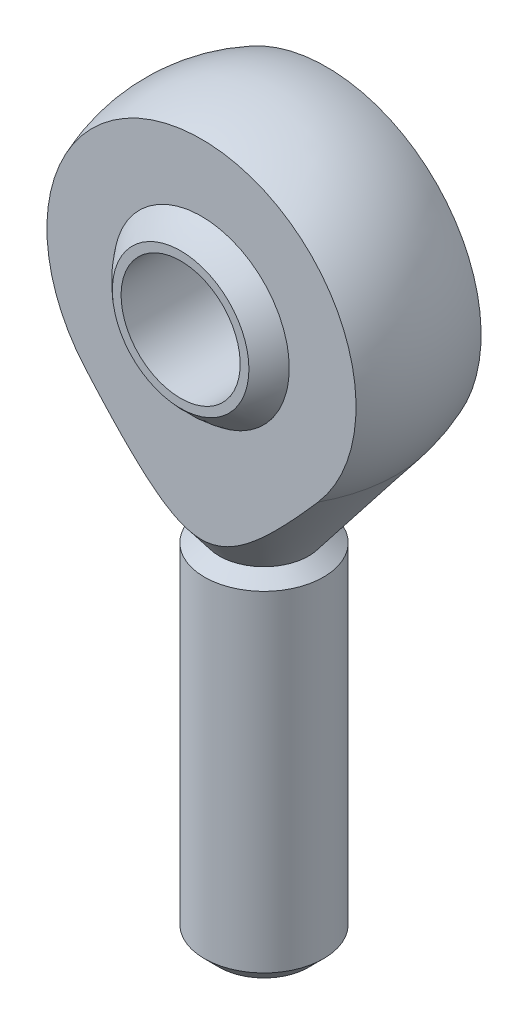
ISO-10303-21;
HEADER;
FILE_DESCRIPTION(('STEP AP214'),'2;1');
FILE_NAME('part.step','',(''),(''),'','','');
FILE_SCHEMA(('AUTOMOTIVE_DESIGN { 1 0 10303 214 1 1 1 1 }'));
ENDSEC;
DATA;
#1=APPLICATION_CONTEXT('core data for automotive mechanical design processes');
#2=APPLICATION_PROTOCOL_DEFINITION('international standard','automotive_design',2000,#1);
#3=PRODUCT_CONTEXT('',#1,'mechanical');
#4=PRODUCT('Part','Part','',(#3));
#5=PRODUCT_RELATED_PRODUCT_CATEGORY('part','',(#4));
#6=PRODUCT_DEFINITION_FORMATION('','',#4);
#7=PRODUCT_DEFINITION_CONTEXT('part definition',#1,'design');
#8=PRODUCT_DEFINITION('design','',#6,#7);
#9=PRODUCT_DEFINITION_SHAPE('','',#8);
#10=(LENGTH_UNIT() NAMED_UNIT(*) SI_UNIT(.MILLI.,.METRE.));
#11=(NAMED_UNIT(*) PLANE_ANGLE_UNIT() SI_UNIT($,.RADIAN.));
#12=(NAMED_UNIT(*) SI_UNIT($,.STERADIAN.) SOLID_ANGLE_UNIT());
#13=UNCERTAINTY_MEASURE_WITH_UNIT(LENGTH_MEASURE(1.E-05),#10,'distance_accuracy_value','');
#14=(GEOMETRIC_REPRESENTATION_CONTEXT(3) GLOBAL_UNCERTAINTY_ASSIGNED_CONTEXT((#13)) GLOBAL_UNIT_ASSIGNED_CONTEXT((#10,
#11,#12)) REPRESENTATION_CONTEXT('',''));
#15=CARTESIAN_POINT('',(0.,0.,0.));
#16=DIRECTION('',(0.,0.,1.));
#17=DIRECTION('',(1.,0.,0.));
#18=AXIS2_PLACEMENT_3D('',#15,#16,#17);
#19=CARTESIAN_POINT('',(0.,0.,0.));
#20=DIRECTION('',(0.,0.,1.));
#21=DIRECTION('',(-1.,0.,0.));
#22=AXIS2_PLACEMENT_3D('',#19,#20,#21);
#23=SPHERICAL_SURFACE('',#22,9.04875);
#24=CARTESIAN_POINT('',(0.,0.,-5.25000000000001));
#25=DIRECTION('',(0.,0.,1.));
#26=DIRECTION('',(1.,0.,0.));
#27=AXIS2_PLACEMENT_3D('',#24,#25,#26);
#28=CIRCLE('',#27,7.3700323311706);
#29=CARTESIAN_POINT('',(7.3700323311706,0.,-5.25000000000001));
#30=VERTEX_POINT('',#29);
#31=EDGE_CURVE('P0_E53',#30,#30,#28,.T.);
#32=ORIENTED_EDGE('',*,*,#31,.F.);
#33=EDGE_LOOP('',(#32));
#34=FACE_BOUND('',#33,.T.);
#35=CARTESIAN_POINT('',(0.,0.,5.25));
#36=DIRECTION('',(0.,0.,1.));
#37=DIRECTION('',(1.,0.,0.));
#38=AXIS2_PLACEMENT_3D('',#35,#36,#37);
#39=CIRCLE('',#38,7.3700323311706);
#40=CARTESIAN_POINT('',(7.3700323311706,0.,5.25));
#41=VERTEX_POINT('',#40);
#42=EDGE_CURVE('P0_E21',#41,#41,#39,.F.);
#43=ORIENTED_EDGE('',*,*,#42,.F.);
#44=EDGE_LOOP('',(#43));
#45=FACE_BOUND('',#44,.T.);
#46=ADVANCED_FACE('P0_F17',(#34,#45),#23,.F.);
#47=CARTESIAN_POINT('',(12.9783473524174,-19.7418582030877,5.25));
#48=CARTESIAN_POINT('',(12.9783473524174,12.9783473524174,5.25));
#49=CARTESIAN_POINT('',(12.9783473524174,13.3055494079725,5.25));
#50=B_SPLINE_CURVE_WITH_KNOTS('',1,(#47,#48,#49),.UNSPECIFIED.,.F.,.F.,(2,1,2),(0.,1.,1.01),.UNSPECIFIED.);
#51=DIRECTION('',(-1.,0.,0.));
#52=VECTOR('',#51,1.);
#53=SURFACE_OF_LINEAR_EXTRUSION('',#50,#52);
#54=ORIENTED_EDGE('',*,*,#42,.T.);
#55=EDGE_LOOP('',(#54));
#56=FACE_BOUND('',#55,.T.);
#57=CARTESIAN_POINT('',(0.,0.,5.25));
#58=DIRECTION('',(0.,0.,1.));
#59=DIRECTION('',(1.,0.,0.));
#60=AXIS2_PLACEMENT_3D('',#57,#58,#59);
#61=CIRCLE('',#60,12.9783473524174);
#62=CARTESIAN_POINT('',(-9.77969864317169,-8.53199826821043,5.25));
#63=VERTEX_POINT('',#62);
#64=CARTESIAN_POINT('',(9.77969864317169,-8.53199826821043,5.25));
#65=VERTEX_POINT('',#64);
#66=EDGE_CURVE('P0_E48',#63,#65,#61,.F.);
#67=ORIENTED_EDGE('',*,*,#66,.F.);
#68=CARTESIAN_POINT('',(9.77969864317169,-8.53199826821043,5.25));
#69=CARTESIAN_POINT('',(9.59097869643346,-8.74829449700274,5.25));
#70=CARTESIAN_POINT('',(9.40158357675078,-8.96400566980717,5.25));
#71=CARTESIAN_POINT('',(9.02091170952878,-9.39427916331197,5.25));
#72=CARTESIAN_POINT('',(8.82963277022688,-9.60883954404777,5.25));
#73=CARTESIAN_POINT('',(8.44501454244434,-10.0364201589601,5.25));
#74=CARTESIAN_POINT('',(8.25167372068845,-10.249439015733,5.25));
#75=CARTESIAN_POINT('',(7.86266047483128,-10.6734599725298,5.25));
#76=CARTESIAN_POINT('',(7.6669873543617,-10.8844614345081,5.25));
#77=CARTESIAN_POINT('',(7.27256005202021,-11.3042814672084,5.25));
#78=CARTESIAN_POINT('',(7.07380097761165,-11.5130954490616,5.25));
#79=CARTESIAN_POINT('',(6.6730216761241,-11.9274511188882,5.25));
#80=CARTESIAN_POINT('',(6.47100249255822,-12.1329938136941,5.25));
#81=CARTESIAN_POINT('',(6.06296651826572,-12.5399149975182,5.25));
#82=CARTESIAN_POINT('',(5.85695138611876,-12.7412951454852,5.25));
#83=CARTESIAN_POINT('',(5.4398911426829,-13.1387229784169,5.25));
#84=CARTESIAN_POINT('',(5.22884706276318,-13.3347717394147,5.25));
#85=CARTESIAN_POINT('',(4.86593865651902,-13.6608677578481,5.25));
#86=CARTESIAN_POINT('',(4.71572830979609,-13.7927529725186,5.25));
#87=CARTESIAN_POINT('',(4.41165704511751,-14.0522806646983,5.25));
#88=CARTESIAN_POINT('',(4.2577959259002,-14.1799229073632,5.25));
#89=CARTESIAN_POINT('',(3.94511498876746,-14.4303670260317,5.25));
#90=CARTESIAN_POINT('',(3.78627727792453,-14.5531466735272,5.25));
#91=CARTESIAN_POINT('',(3.46344733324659,-14.7917755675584,5.25));
#92=CARTESIAN_POINT('',(3.2994551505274,-14.9076248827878,5.25));
#93=CARTESIAN_POINT('',(2.96273128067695,-15.1320831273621,5.25));
#94=CARTESIAN_POINT('',(2.78990178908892,-15.240546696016,5.25));
#95=CARTESIAN_POINT('',(2.43693390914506,-15.4451795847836,5.25));
#96=CARTESIAN_POINT('',(2.25679300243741,-15.5413446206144,5.25));
#97=CARTESIAN_POINT('',(1.8897568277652,-15.7166883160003,5.25));
#98=CARTESIAN_POINT('',(1.70291361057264,-15.7959742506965,5.25));
#99=CARTESIAN_POINT('',(1.321580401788,-15.9332463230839,5.25000000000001));
#100=CARTESIAN_POINT('',(1.12710059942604,-15.9912598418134,5.25000000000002));
#101=CARTESIAN_POINT('',(0.811335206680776,-16.0629011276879,5.25000000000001));
#102=CARTESIAN_POINT('',(0.691950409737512,-16.0849994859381,5.25));
#103=CARTESIAN_POINT('',(0.451709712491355,-16.1188355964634,5.25));
#104=CARTESIAN_POINT('',(0.330854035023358,-16.1305748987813,5.25));
#105=CARTESIAN_POINT('',(0.088650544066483,-16.1431518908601,5.25));
#106=CARTESIAN_POINT('',(-0.0326969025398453,-16.1439965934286,5.25));
#107=CARTESIAN_POINT('',(-0.274976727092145,-16.1347649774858,5.25));
#108=CARTESIAN_POINT('',(-0.395909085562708,-16.124688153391,5.25));
#109=CARTESIAN_POINT('',(-0.635827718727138,-16.0941499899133,5.25));
#110=CARTESIAN_POINT('',(-0.75482067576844,-16.0737404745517,5.25));
#111=CARTESIAN_POINT('',(-0.99078084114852,-16.0234002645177,5.25));
#112=CARTESIAN_POINT('',(-1.10774757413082,-15.9934673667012,5.25));
#113=CARTESIAN_POINT('',(-1.3393386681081,-15.9250890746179,5.25));
#114=CARTESIAN_POINT('',(-1.45395913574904,-15.8866306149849,5.25));
#115=CARTESIAN_POINT('',(-1.68043389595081,-15.8023536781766,5.25));
#116=CARTESIAN_POINT('',(-1.79228816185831,-15.7565351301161,5.25));
#117=CARTESIAN_POINT('',(-2.08281600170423,-15.6277529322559,5.25));
#118=CARTESIAN_POINT('',(-2.25917968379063,-15.5395763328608,5.25));
#119=CARTESIAN_POINT('',(-2.60511068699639,-15.3504132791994,5.25));
#120=CARTESIAN_POINT('',(-2.77466721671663,-15.2494074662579,5.25));
#121=CARTESIAN_POINT('',(-3.10770819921,-15.0376453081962,5.25));
#122=CARTESIAN_POINT('',(-3.27118791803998,-14.9268815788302,5.25));
#123=CARTESIAN_POINT('',(-3.59469152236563,-14.6965949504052,5.25));
#124=CARTESIAN_POINT('',(-3.75465302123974,-14.5769850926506,5.25));
#125=CARTESIAN_POINT('',(-4.06981430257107,-14.3319871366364,5.25));
#126=CARTESIAN_POINT('',(-4.22501854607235,-14.2066047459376,5.25));
#127=CARTESIAN_POINT('',(-4.53150386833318,-13.9512323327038,5.25));
#128=CARTESIAN_POINT('',(-4.68278594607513,-13.821243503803,5.25));
#129=CARTESIAN_POINT('',(-5.01584234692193,-13.5278029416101,5.25));
#130=CARTESIAN_POINT('',(-5.19679378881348,-13.3634193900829,5.25));
#131=CARTESIAN_POINT('',(-5.55470103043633,-13.0302986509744,5.25));
#132=CARTESIAN_POINT('',(-5.73165593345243,-12.8615605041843,5.25));
#133=CARTESIAN_POINT('',(-6.08231113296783,-12.5205828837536,5.25));
#134=CARTESIAN_POINT('',(-6.25600988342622,-12.3483418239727,5.25));
#135=CARTESIAN_POINT('',(-6.60070014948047,-12.0010245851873,5.25));
#136=CARTESIAN_POINT('',(-6.77169041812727,-11.8259471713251,5.25));
#137=CARTESIAN_POINT('',(-7.11137512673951,-11.4734861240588,5.25));
#138=CARTESIAN_POINT('',(-7.28006889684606,-11.2961018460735,5.25));
#139=CARTESIAN_POINT('',(-7.60701262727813,-10.948452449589,5.25));
#140=CARTESIAN_POINT('',(-7.76536039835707,-10.7782791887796,5.25));
#141=CARTESIAN_POINT('',(-8.08046888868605,-10.4365510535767,5.25));
#142=CARTESIAN_POINT('',(-8.23723000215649,-10.2649965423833,5.25));
#143=CARTESIAN_POINT('',(-8.54931138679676,-9.92078147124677,5.25));
#144=CARTESIAN_POINT('',(-8.70463251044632,-9.74812168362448,5.25));
#145=CARTESIAN_POINT('',(-9.01394446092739,-9.40193981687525,5.25));
#146=CARTESIAN_POINT('',(-9.16793650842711,-9.22841882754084,5.25));
#147=CARTESIAN_POINT('',(-9.47466567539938,-8.88072577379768,5.25));
#148=CARTESIAN_POINT('',(-9.62740431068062,-8.7065550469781,5.25));
#149=CARTESIAN_POINT('',(-9.77969864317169,-8.53199826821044,5.25));
#150=B_SPLINE_CURVE_WITH_KNOTS('',3,(#68,#69,#70,#71,#72,#73,#74,#75,#76,#77,#78,#79,#80,#81,
#82,#83,#84,#85,#86,#87,#88,#89,#90,#91,#92,#93,#94,#95,#96,#97,#98,#99,#100,#101,#102,#103,
#104,#105,#106,#107,#108,#109,#110,#111,#112,#113,#114,#115,#116,#117,#118,#119,#120,#121,#122,
#123,#124,#125,#126,#127,#128,#129,#130,#131,#132,#133,#134,#135,#136,#137,#138,#139,#140,#141,
#142,#143,#144,#145,#146,#147,#148,#149),.UNSPECIFIED.,.F.,.F.,(4,2,2,2,2,2,2,2,2,2,2,2,2,2,2,2,
2,2,2,2,2,2,2,2,2,2,2,2,2,2,2,2,2,2,2,2,2,2,2,2,4),(0.,0.861161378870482,1.72348327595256,
2.58649867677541,3.44977855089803,4.31460528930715,5.17916049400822,6.04336422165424,
6.90739221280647,7.50700713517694,8.10665519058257,8.70878595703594,9.3109107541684,
9.92266168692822,10.5346251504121,11.1425748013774,11.7497391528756,12.1135837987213,
12.4773739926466,12.8409300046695,13.2045028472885,13.5662699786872,13.9281208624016,
14.2905301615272,14.6529429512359,15.2437300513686,15.8354194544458,16.4275605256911,
17.0265950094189,17.6250494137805,18.22334986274,18.9566645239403,19.6901421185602,
20.4239595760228,21.1581055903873,21.8924613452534,22.5898001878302,23.2869612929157,
23.9836792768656,24.6796691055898,25.3746325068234),.UNSPECIFIED.);
#151=EDGE_CURVE('P0_E51',#65,#63,#150,.T.);
#152=ORIENTED_EDGE('',*,*,#151,.F.);
#153=EDGE_LOOP('',(#67,#152));
#154=FACE_BOUND('',#153,.T.);
#155=ADVANCED_FACE('P0_F50',(#56,#154),#53,.T.);
#156=CARTESIAN_POINT('',(12.9783473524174,13.3055494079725,-5.25000000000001));
#157=CARTESIAN_POINT('',(12.9783473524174,12.9783473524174,-5.25000000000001));
#158=CARTESIAN_POINT('',(12.9783473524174,-19.7418582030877,-5.25000000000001));
#159=B_SPLINE_CURVE_WITH_KNOTS('',1,(#156,#157,#158),.UNSPECIFIED.,.F.,.F.,(2,1,2),(-0.01,0.,
1.),.UNSPECIFIED.);
#160=DIRECTION('',(-1.,0.,0.));
#161=VECTOR('',#160,1.);
#162=SURFACE_OF_LINEAR_EXTRUSION('',#159,#161);
#163=ORIENTED_EDGE('',*,*,#31,.T.);
#164=EDGE_LOOP('',(#163));
#165=FACE_BOUND('',#164,.T.);
#166=CARTESIAN_POINT('',(-9.77969864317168,-8.53199826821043,-5.25000000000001));
#167=CARTESIAN_POINT('',(-9.59097869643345,-8.74829449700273,-5.25000000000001));
#168=CARTESIAN_POINT('',(-9.40158357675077,-8.96400566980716,-5.25000000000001));
#169=CARTESIAN_POINT('',(-9.02091170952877,-9.39427916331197,-5.25000000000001));
#170=CARTESIAN_POINT('',(-8.82963277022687,-9.60883954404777,-5.25000000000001));
#171=CARTESIAN_POINT('',(-8.44501454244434,-10.0364201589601,-5.25000000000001));
#172=CARTESIAN_POINT('',(-8.25167372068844,-10.249439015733,-5.25000000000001));
#173=CARTESIAN_POINT('',(-7.86266047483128,-10.6734599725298,-5.25000000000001));
#174=CARTESIAN_POINT('',(-7.66698735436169,-10.8844614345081,-5.25000000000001));
#175=CARTESIAN_POINT('',(-7.27256005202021,-11.3042814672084,-5.25000000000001));
#176=CARTESIAN_POINT('',(-7.07380097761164,-11.5130954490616,-5.25000000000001));
#177=CARTESIAN_POINT('',(-6.6730216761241,-11.9274511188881,-5.25000000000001));
#178=CARTESIAN_POINT('',(-6.47100249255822,-12.1329938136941,-5.25000000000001));
#179=CARTESIAN_POINT('',(-6.06296651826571,-12.5399149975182,-5.25000000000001));
#180=CARTESIAN_POINT('',(-5.85695138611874,-12.7412951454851,-5.25000000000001));
#181=CARTESIAN_POINT('',(-5.43989114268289,-13.1387229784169,-5.25000000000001));
#182=CARTESIAN_POINT('',(-5.22884706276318,-13.3347717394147,-5.25000000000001));
#183=CARTESIAN_POINT('',(-4.86593865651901,-13.6608677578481,-5.25000000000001));
#184=CARTESIAN_POINT('',(-4.71572830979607,-13.7927529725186,-5.25000000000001));
#185=CARTESIAN_POINT('',(-4.4116570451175,-14.0522806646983,-5.25000000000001));
#186=CARTESIAN_POINT('',(-4.25779592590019,-14.1799229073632,-5.25000000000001));
#187=CARTESIAN_POINT('',(-3.94511498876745,-14.4303670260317,-5.25000000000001));
#188=CARTESIAN_POINT('',(-3.78627727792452,-14.5531466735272,-5.25000000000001));
#189=CARTESIAN_POINT('',(-3.46344733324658,-14.7917755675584,-5.25000000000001));
#190=CARTESIAN_POINT('',(-3.29945515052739,-14.9076248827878,-5.25000000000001));
#191=CARTESIAN_POINT('',(-2.96273128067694,-15.1320831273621,-5.25000000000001));
#192=CARTESIAN_POINT('',(-2.78990178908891,-15.240546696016,-5.25000000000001));
#193=CARTESIAN_POINT('',(-2.43693390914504,-15.4451795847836,-5.25000000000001));
#194=CARTESIAN_POINT('',(-2.2567930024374,-15.5413446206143,-5.25000000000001));
#195=CARTESIAN_POINT('',(-1.88975682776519,-15.7166883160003,-5.25000000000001));
#196=CARTESIAN_POINT('',(-1.70291361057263,-15.7959742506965,-5.25));
#197=CARTESIAN_POINT('',(-1.32158040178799,-15.9332463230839,-5.25000000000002));
#198=CARTESIAN_POINT('',(-1.12710059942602,-15.9912598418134,-5.25000000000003));
#199=CARTESIAN_POINT('',(-0.811335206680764,-16.0629011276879,-5.25000000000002));
#200=CARTESIAN_POINT('',(-0.6919504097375,-16.0849994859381,-5.25000000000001));
#201=CARTESIAN_POINT('',(-0.451709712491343,-16.1188355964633,-5.25000000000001));
#202=CARTESIAN_POINT('',(-0.330854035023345,-16.1305748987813,-5.25000000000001));
#203=CARTESIAN_POINT('',(-0.0886505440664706,-16.14315189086,-5.25000000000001));
#204=CARTESIAN_POINT('',(0.0326969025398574,-16.1439965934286,-5.25000000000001));
#205=CARTESIAN_POINT('',(0.274976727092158,-16.1347649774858,-5.25000000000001));
#206=CARTESIAN_POINT('',(0.395909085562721,-16.124688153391,-5.25000000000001));
#207=CARTESIAN_POINT('',(0.63582771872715,-16.0941499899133,-5.25000000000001));
#208=CARTESIAN_POINT('',(0.75482067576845,-16.0737404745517,-5.25000000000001));
#209=CARTESIAN_POINT('',(0.990780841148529,-16.0234002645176,-5.25000000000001));
#210=CARTESIAN_POINT('',(1.10774757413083,-15.9934673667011,-5.25000000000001));
#211=CARTESIAN_POINT('',(1.33933866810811,-15.9250890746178,-5.25000000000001));
#212=CARTESIAN_POINT('',(1.45395913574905,-15.8866306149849,-5.25000000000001));
#213=CARTESIAN_POINT('',(1.68043389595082,-15.8023536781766,-5.25000000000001));
#214=CARTESIAN_POINT('',(1.79228816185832,-15.756535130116,-5.25000000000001));
#215=CARTESIAN_POINT('',(2.08281600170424,-15.6277529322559,-5.25000000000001));
#216=CARTESIAN_POINT('',(2.25917968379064,-15.5395763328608,-5.25000000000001));
#217=CARTESIAN_POINT('',(2.6051106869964,-15.3504132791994,-5.25000000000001));
#218=CARTESIAN_POINT('',(2.77466721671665,-15.2494074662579,-5.25000000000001));
#219=CARTESIAN_POINT('',(3.10770819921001,-15.0376453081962,-5.25000000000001));
#220=CARTESIAN_POINT('',(3.27118791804,-14.9268815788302,-5.25000000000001));
#221=CARTESIAN_POINT('',(3.59469152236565,-14.6965949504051,-5.25000000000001));
#222=CARTESIAN_POINT('',(3.75465302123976,-14.5769850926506,-5.25000000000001));
#223=CARTESIAN_POINT('',(4.0698143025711,-14.3319871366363,-5.25000000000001));
#224=CARTESIAN_POINT('',(4.22501854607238,-14.2066047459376,-5.25000000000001));
#225=CARTESIAN_POINT('',(4.53150386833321,-13.9512323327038,-5.25000000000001));
#226=CARTESIAN_POINT('',(4.68278594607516,-13.821243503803,-5.25000000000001));
#227=CARTESIAN_POINT('',(5.01584234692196,-13.52780294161,-5.25000000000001));
#228=CARTESIAN_POINT('',(5.19679378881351,-13.3634193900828,-5.25000000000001));
#229=CARTESIAN_POINT('',(5.55470103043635,-13.0302986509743,-5.25000000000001));
#230=CARTESIAN_POINT('',(5.73165593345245,-12.8615605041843,-5.25000000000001));
#231=CARTESIAN_POINT('',(6.08231113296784,-12.5205828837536,-5.25000000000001));
#232=CARTESIAN_POINT('',(6.25600988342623,-12.3483418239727,-5.25000000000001));
#233=CARTESIAN_POINT('',(6.60070014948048,-12.0010245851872,-5.25000000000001));
#234=CARTESIAN_POINT('',(6.77169041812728,-11.825947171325,-5.25000000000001));
#235=CARTESIAN_POINT('',(7.11137512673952,-11.4734861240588,-5.25000000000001));
#236=CARTESIAN_POINT('',(7.28006889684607,-11.2961018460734,-5.25000000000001));
#237=CARTESIAN_POINT('',(7.60701262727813,-10.9484524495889,-5.25000000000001));
#238=CARTESIAN_POINT('',(7.76536039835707,-10.7782791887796,-5.25000000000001));
#239=CARTESIAN_POINT('',(8.08046888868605,-10.4365510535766,-5.25000000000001));
#240=CARTESIAN_POINT('',(8.23723000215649,-10.2649965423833,-5.25000000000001));
#241=CARTESIAN_POINT('',(8.54931138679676,-9.92078147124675,-5.25000000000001));
#242=CARTESIAN_POINT('',(8.70463251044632,-9.74812168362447,-5.25000000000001));
#243=CARTESIAN_POINT('',(9.01394446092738,-9.40193981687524,-5.25000000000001));
#244=CARTESIAN_POINT('',(9.16793650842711,-9.22841882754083,-5.25000000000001));
#245=CARTESIAN_POINT('',(9.47466567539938,-8.88072577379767,-5.25000000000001));
#246=CARTESIAN_POINT('',(9.62740431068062,-8.70655504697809,-5.25000000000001));
#247=CARTESIAN_POINT('',(9.77969864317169,-8.53199826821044,-5.25000000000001));
#248=B_SPLINE_CURVE_WITH_KNOTS('',3,(#166,#167,#168,#169,#170,#171,#172,#173,#174,#175,#176,
#177,#178,#179,#180,#181,#182,#183,#184,#185,#186,#187,#188,#189,#190,#191,#192,#193,#194,#195,
#196,#197,#198,#199,#200,#201,#202,#203,#204,#205,#206,#207,#208,#209,#210,#211,#212,#213,#214,
#215,#216,#217,#218,#219,#220,#221,#222,#223,#224,#225,#226,#227,#228,#229,#230,#231,#232,#233,
#234,#235,#236,#237,#238,#239,#240,#241,#242,#243,#244,#245,#246,#247),.UNSPECIFIED.,.F.,.F.,(4,
2,2,2,2,2,2,2,2,2,2,2,2,2,2,2,2,2,2,2,2,2,2,2,2,2,2,2,2,2,2,2,2,2,2,2,2,2,2,2,4),(0.,
0.861161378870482,1.72348327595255,2.58649867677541,3.44977855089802,4.31460528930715,
5.17916049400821,6.04336422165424,6.90739221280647,7.50700713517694,8.10665519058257,
8.70878595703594,9.3109107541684,9.92266168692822,10.5346251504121,11.1425748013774,
11.7497391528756,12.1135837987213,12.4773739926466,12.8409300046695,13.2045028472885,
13.5662699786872,13.9281208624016,14.2905301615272,14.6529429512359,15.2437300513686,
15.8354194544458,16.4275605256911,17.0265950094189,17.6250494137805,18.2233498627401,
18.9566645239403,19.6901421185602,20.4239595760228,21.1581055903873,21.8924613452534,
22.5898001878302,23.2869612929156,23.9836792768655,24.6796691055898,25.3746325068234),.UNSPECIFIED.);
#249=CARTESIAN_POINT('',(-9.77969864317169,-8.53199826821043,-5.25000000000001));
#250=VERTEX_POINT('',#249);
#251=CARTESIAN_POINT('',(9.77969864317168,-8.53199826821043,-5.25000000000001));
#252=VERTEX_POINT('',#251);
#253=EDGE_CURVE('P0_E58',#250,#252,#248,.T.);
#254=ORIENTED_EDGE('',*,*,#253,.F.);
#255=CARTESIAN_POINT('',(0.,0.,-5.25000000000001));
#256=DIRECTION('',(0.,0.,1.));
#257=DIRECTION('',(1.,0.,0.));
#258=AXIS2_PLACEMENT_3D('',#255,#256,#257);
#259=CIRCLE('',#258,12.9783473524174);
#260=EDGE_CURVE('P0_E35',#252,#250,#259,.T.);
#261=ORIENTED_EDGE('',*,*,#260,.F.);
#262=EDGE_LOOP('',(#254,#261));
#263=FACE_BOUND('',#262,.T.);
#264=ADVANCED_FACE('P0_F76',(#165,#263),#162,.T.);
#265=CARTESIAN_POINT('',(0.,0.,0.));
#266=DIRECTION('',(0.,0.,1.));
#267=DIRECTION('',(1.,0.,0.));
#268=AXIS2_PLACEMENT_3D('',#265,#266,#267);
#269=SPHERICAL_SURFACE('',#268,14.);
#270=CARTESIAN_POINT('',(0.,-8.53199826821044,0.));
#271=DIRECTION('',(0.,1.,0.));
#272=DIRECTION('',(0.,0.,1.));
#273=AXIS2_PLACEMENT_3D('',#270,#271,#272);
#274=CIRCLE('',#273,11.0997750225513);
#275=EDGE_CURVE('P0_E43',#252,#65,#274,.F.);
#276=ORIENTED_EDGE('',*,*,#275,.F.);
#277=ORIENTED_EDGE('',*,*,#260,.T.);
#278=CARTESIAN_POINT('',(0.,-8.53199826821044,0.));
#279=DIRECTION('',(0.,1.,0.));
#280=DIRECTION('',(0.,0.,1.));
#281=AXIS2_PLACEMENT_3D('',#278,#279,#280);
#282=CIRCLE('',#281,11.0997750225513);
#283=EDGE_CURVE('P0_E56',#63,#250,#282,.F.);
#284=ORIENTED_EDGE('',*,*,#283,.F.);
#285=ORIENTED_EDGE('',*,*,#66,.T.);
#286=EDGE_LOOP('',(#276,#277,#284,#285));
#287=FACE_BOUND('',#286,.T.);
#288=ADVANCED_FACE('P0_F57',(#287),#269,.T.);
#289=CARTESIAN_POINT('',(0.,-18.09375,0.));
#290=DIRECTION('',(0.,1.,0.));
#291=DIRECTION('',(0.,0.,1.));
#292=AXIS2_PLACEMENT_3D('',#289,#290,#291);
#293=CONICAL_SURFACE('',#292,3.75,0.655339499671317);
#294=ORIENTED_EDGE('',*,*,#151,.T.);
#295=ORIENTED_EDGE('',*,*,#283,.T.);
#296=ORIENTED_EDGE('',*,*,#253,.T.);
#297=ORIENTED_EDGE('',*,*,#275,.T.);
#298=EDGE_LOOP('',(#294,#295,#296,#297));
#299=FACE_BOUND('',#298,.T.);
#300=CARTESIAN_POINT('',(0.,-18.09375,0.));
#301=DIRECTION('',(0.,1.,0.));
#302=DIRECTION('',(0.,0.,1.));
#303=AXIS2_PLACEMENT_3D('',#300,#301,#302);
#304=CIRCLE('',#303,3.75);
#305=CARTESIAN_POINT('',(0.,-18.09375,3.75));
#306=VERTEX_POINT('',#305);
#307=EDGE_CURVE('P0_E92',#306,#306,#304,.F.);
#308=ORIENTED_EDGE('',*,*,#307,.F.);
#309=EDGE_LOOP('',(#308));
#310=FACE_BOUND('',#309,.T.);
#311=ADVANCED_FACE('P0_F60',(#299,#310),#293,.T.);
#312=CARTESIAN_POINT('',(0.,-18.09375,0.));
#313=DIRECTION('',(0.,-1.,0.));
#314=DIRECTION('',(1.,0.,0.));
#315=AXIS2_PLACEMENT_3D('',#312,#313,#314);
#316=CONICAL_SURFACE('',#315,3.75,0.943488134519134);
#317=ORIENTED_EDGE('',*,*,#307,.T.);
#318=EDGE_LOOP('',(#317));
#319=FACE_BOUND('',#318,.T.);
#320=CARTESIAN_POINT('',(0.,-19.,0.));
#321=DIRECTION('',(0.,-1.,0.));
#322=DIRECTION('',(0.,0.,1.));
#323=AXIS2_PLACEMENT_3D('',#320,#321,#322);
#324=CIRCLE('',#323,5.);
#325=CARTESIAN_POINT('',(0.,-19.,5.));
#326=VERTEX_POINT('',#325);
#327=EDGE_CURVE('P0_E130',#326,#326,#324,.T.);
#328=ORIENTED_EDGE('',*,*,#327,.F.);
#329=EDGE_LOOP('',(#328));
#330=FACE_BOUND('',#329,.T.);
#331=ADVANCED_FACE('P0_F118',(#319,#330),#316,.T.);
#332=CARTESIAN_POINT('',(0.,-46.75,0.));
#333=DIRECTION('',(0.,-1.,0.));
#334=DIRECTION('',(0.,0.,-1.));
#335=AXIS2_PLACEMENT_3D('',#332,#333,#334);
#336=CYLINDRICAL_SURFACE('',#335,5.);
#337=ORIENTED_EDGE('',*,*,#327,.T.);
#338=EDGE_LOOP('',(#337));
#339=FACE_BOUND('',#338,.T.);
#340=CARTESIAN_POINT('',(0.,-46.75,0.));
#341=DIRECTION('',(0.,-1.,0.));
#342=DIRECTION('',(0.,0.,1.));
#343=AXIS2_PLACEMENT_3D('',#340,#341,#342);
#344=CIRCLE('',#343,5.00000000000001);
#345=CARTESIAN_POINT('',(0.,-46.75,5.00000000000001));
#346=VERTEX_POINT('',#345);
#347=EDGE_CURVE('P0_E27',#346,#346,#344,.T.);
#348=ORIENTED_EDGE('',*,*,#347,.F.);
#349=EDGE_LOOP('',(#348));
#350=FACE_BOUND('',#349,.T.);
#351=ADVANCED_FACE('P0_F111',(#339,#350),#336,.T.);
#352=CARTESIAN_POINT('',(3.79500210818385,-48.,-3.75));
#353=DIRECTION('',(0.,-1.,0.));
#354=DIRECTION('',(0.,0.,1.));
#355=AXIS2_PLACEMENT_3D('',#352,#353,#354);
#356=PLANE('',#355);
#357=CARTESIAN_POINT('',(0.,-48.,0.));
#358=DIRECTION('',(0.,1.,0.));
#359=DIRECTION('',(0.,0.,1.));
#360=AXIS2_PLACEMENT_3D('',#357,#358,#359);
#361=CIRCLE('',#360,3.75);
#362=CARTESIAN_POINT('',(0.,-48.,3.75));
#363=VERTEX_POINT('',#362);
#364=EDGE_CURVE('P0_E11',#363,#363,#361,.T.);
#365=ORIENTED_EDGE('',*,*,#364,.F.);
#366=EDGE_LOOP('',(#365));
#367=FACE_BOUND('',#366,.T.);
#368=ADVANCED_FACE('P0_F105',(#367),#356,.T.);
#369=CARTESIAN_POINT('',(0.,-48.,0.));
#370=DIRECTION('',(0.,1.,0.));
#371=DIRECTION('',(0.,0.,1.));
#372=AXIS2_PLACEMENT_3D('',#369,#370,#371);
#373=CONICAL_SURFACE('',#372,3.75,0.785398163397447);
#374=ORIENTED_EDGE('',*,*,#347,.T.);
#375=EDGE_LOOP('',(#374));
#376=FACE_BOUND('',#375,.T.);
#377=ORIENTED_EDGE('',*,*,#364,.T.);
#378=EDGE_LOOP('',(#377));
#379=FACE_BOUND('',#378,.T.);
#380=ADVANCED_FACE('P0_F103',(#376,#379),#373,.T.);
#381=CLOSED_SHELL('',(#46,#155,#264,#288,#311,#331,#351,#368,#380));
#382=MANIFOLD_SOLID_BREP('P0_B1',#381);
#383=CARTESIAN_POINT('',(0.,0.,-7.));
#384=DIRECTION('',(0.,0.,1.));
#385=DIRECTION('',(0.,-1.,0.));
#386=AXIS2_PLACEMENT_3D('',#383,#384,#385);
#387=CYLINDRICAL_SURFACE('',#386,5.);
#388=CARTESIAN_POINT('',(0.,0.,7.));
#389=DIRECTION('',(0.,0.,1.));
#390=DIRECTION('',(0.,-1.,0.));
#391=AXIS2_PLACEMENT_3D('',#388,#389,#390);
#392=CIRCLE('',#391,5.);
#393=CARTESIAN_POINT('',(0.,-5.,7.));
#394=VERTEX_POINT('',#393);
#395=EDGE_CURVE('P1_E19',#394,#394,#392,.F.);
#396=ORIENTED_EDGE('',*,*,#395,.F.);
#397=EDGE_LOOP('',(#396));
#398=FACE_BOUND('',#397,.T.);
#399=CARTESIAN_POINT('',(0.,0.,-7.));
#400=DIRECTION('',(0.,0.,1.));
#401=DIRECTION('',(0.,-1.,0.));
#402=AXIS2_PLACEMENT_3D('',#399,#400,#401);
#403=CIRCLE('',#402,5.);
#404=CARTESIAN_POINT('',(0.,-5.,-7.));
#405=VERTEX_POINT('',#404);
#406=EDGE_CURVE('P1_E71',#405,#405,#403,.T.);
#407=ORIENTED_EDGE('',*,*,#406,.F.);
#408=EDGE_LOOP('',(#407));
#409=FACE_BOUND('',#408,.T.);
#410=ADVANCED_FACE('P1_F16',(#398,#409),#387,.F.);
#411=CARTESIAN_POINT('',(-5.73409771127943,5.84992648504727,7.));
#412=CARTESIAN_POINT('',(-5.73409771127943,5.73409771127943,7.));
#413=CARTESIAN_POINT('',(-5.73409771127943,-5.73409771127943,7.));
#414=CARTESIAN_POINT('',(-5.73409771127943,-5.84877966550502,7.));
#415=B_SPLINE_CURVE_WITH_KNOTS('',1,(#411,#412,#413,#414),.UNSPECIFIED.,.F.,.F.,(2,1,1,2),
(-0.0101,0.,1.,1.01),.UNSPECIFIED.);
#416=DIRECTION('',(1.,0.,0.));
#417=VECTOR('',#416,1.);
#418=SURFACE_OF_LINEAR_EXTRUSION('',#415,#417);
#419=ORIENTED_EDGE('',*,*,#395,.T.);
#420=EDGE_LOOP('',(#419));
#421=FACE_BOUND('',#420,.T.);
#422=CARTESIAN_POINT('',(5.73409771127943,0.,7.));
#423=CARTESIAN_POINT('',(5.73409682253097,-0.160995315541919,7.));
#424=CARTESIAN_POINT('',(5.72731167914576,-0.322019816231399,7.));
#425=CARTESIAN_POINT('',(5.70021311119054,-0.64295864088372,7.));
#426=CARTESIAN_POINT('',(5.67989569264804,-0.802872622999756,7.));
#427=CARTESIAN_POINT('',(5.62583076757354,-1.12068021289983,7.));
#428=CARTESIAN_POINT('',(5.59206194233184,-1.27857020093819,7.));
#429=CARTESIAN_POINT('',(5.51130175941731,-1.59106754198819,7.));
#430=CARTESIAN_POINT('',(5.46429967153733,-1.74567212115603,7.));
#431=CARTESIAN_POINT('',(5.35751174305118,-2.05010237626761,7.));
#432=CARTESIAN_POINT('',(5.29774805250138,-2.1999358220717,7.));
#433=CARTESIAN_POINT('',(5.16578385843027,-2.49410361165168,7.));
#434=CARTESIAN_POINT('',(5.09357773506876,-2.63843543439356,7.));
#435=CARTESIAN_POINT('',(4.9372579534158,-2.92050705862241,7.));
#436=CARTESIAN_POINT('',(4.85314384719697,-3.05824661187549,7.));
#437=CARTESIAN_POINT('',(4.67364907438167,-3.3260875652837,7.));
#438=CARTESIAN_POINT('',(4.57827351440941,-3.45619238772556,7.));
#439=CARTESIAN_POINT('',(4.37683803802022,-3.70798818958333,7.));
#440=CARTESIAN_POINT('',(4.27077125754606,-3.82967367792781,7.));
#441=CARTESIAN_POINT('',(4.04886668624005,-4.06355954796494,7.));
#442=CARTESIAN_POINT('',(3.9330384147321,-4.17576896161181,7.));
#443=CARTESIAN_POINT('',(3.69229075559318,-4.39008542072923,7.));
#444=CARTESIAN_POINT('',(3.56736727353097,-4.49218786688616,7.));
#445=CARTESIAN_POINT('',(3.30933368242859,-4.68552918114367,7.));
#446=CARTESIAN_POINT('',(3.17622168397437,-4.77676552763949,7.));
#447=CARTESIAN_POINT('',(2.90283008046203,-4.94766946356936,7.));
#448=CARTESIAN_POINT('',(2.76255291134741,-5.02734094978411,7.));
#449=CARTESIAN_POINT('',(2.47573359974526,-5.17461281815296,7.));
#450=CARTESIAN_POINT('',(2.32918916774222,-5.24220874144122,7.));
#451=CARTESIAN_POINT('',(2.03098296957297,-5.36478919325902,7.));
#452=CARTESIAN_POINT('',(1.87932317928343,-5.41977852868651,7.));
#453=CARTESIAN_POINT('',(1.57185332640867,-5.51680626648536,7.));
#454=CARTESIAN_POINT('',(1.41604173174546,-5.5588398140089,7.));
#455=CARTESIAN_POINT('',(1.10149528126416,-5.62961466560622,7.));
#456=CARTESIAN_POINT('',(0.942761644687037,-5.6583613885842,7.));
#457=CARTESIAN_POINT('',(0.62336478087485,-5.70239361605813,7.));
#458=CARTESIAN_POINT('',(0.462700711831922,-5.71767301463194,7.));
#459=CARTESIAN_POINT('',(0.140656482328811,-5.73463969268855,7.));
#460=CARTESIAN_POINT('',(-0.0207236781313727,-5.73632697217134,7.));
#461=CARTESIAN_POINT('',(-0.342979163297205,-5.72609975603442,7.));
#462=CARTESIAN_POINT('',(-0.50385468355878,-5.71419142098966,7.));
#463=CARTESIAN_POINT('',(-0.824096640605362,-5.67685995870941,7.));
#464=CARTESIAN_POINT('',(-0.983462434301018,-5.65143131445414,7.));
#465=CARTESIAN_POINT('',(-1.29942554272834,-5.58724871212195,7.));
#466=CARTESIAN_POINT('',(-1.45602387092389,-5.54849974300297,7.));
#467=CARTESIAN_POINT('',(-1.7654596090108,-5.45793248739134,7.));
#468=CARTESIAN_POINT('',(-1.91829555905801,-5.40610921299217,7.));
#469=CARTESIAN_POINT('',(-2.21900194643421,-5.28979073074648,7.));
#470=CARTESIAN_POINT('',(-2.36687419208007,-5.22530019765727,7.));
#471=CARTESIAN_POINT('',(-2.6567103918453,-5.08406952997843,7.));
#472=CARTESIAN_POINT('',(-2.79867233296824,-5.00732526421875,7.));
#473=CARTESIAN_POINT('',(-3.07559319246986,-4.84216765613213,7.));
#474=CARTESIAN_POINT('',(-3.21055372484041,-4.75375701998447,7.));
#475=CARTESIAN_POINT('',(-3.47248835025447,-4.56592403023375,7.));
#476=CARTESIAN_POINT('',(-3.59946603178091,-4.46650668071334,7.));
#477=CARTESIAN_POINT('',(-3.84471817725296,-4.25723264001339,7.));
#478=CARTESIAN_POINT('',(-3.9629841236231,-4.14736596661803,7.));
#479=CARTESIAN_POINT('',(-4.18976241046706,-3.91813031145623,7.));
#480=CARTESIAN_POINT('',(-4.29828100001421,-3.79876751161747,7.));
#481=CARTESIAN_POINT('',(-4.50492602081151,-3.55127006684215,7.));
#482=CARTESIAN_POINT('',(-4.60304773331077,-3.42313148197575,7.));
#483=CARTESIAN_POINT('',(-4.78814137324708,-3.15904698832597,7.));
#484=CARTESIAN_POINT('',(-4.87511372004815,-3.02310137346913,7.));
#485=CARTESIAN_POINT('',(-5.03725763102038,-2.74442846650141,7.));
#486=CARTESIAN_POINT('',(-5.11243451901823,-2.60170427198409,7.));
#487=CARTESIAN_POINT('',(-5.2506198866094,-2.31018026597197,7.));
#488=CARTESIAN_POINT('',(-5.31360715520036,-2.16137040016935,7.));
#489=CARTESIAN_POINT('',(-5.42675652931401,-1.85908905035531,7.));
#490=CARTESIAN_POINT('',(-5.47692901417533,-1.70562145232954,7.));
#491=CARTESIAN_POINT('',(-5.56408889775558,-1.39525419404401,7.));
#492=CARTESIAN_POINT('',(-5.60109711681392,-1.23836037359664,7.));
#493=CARTESIAN_POINT('',(-5.66176894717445,-0.922045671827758,7.));
#494=CARTESIAN_POINT('',(-5.68543649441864,-0.762625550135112,7.));
#495=CARTESIAN_POINT('',(-5.71292699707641,-0.502465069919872,7.));
#496=CARTESIAN_POINT('',(-5.72086353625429,-0.402141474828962,7.));
#497=CARTESIAN_POINT('',(-5.73144917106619,-0.201215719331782,7.));
#498=CARTESIAN_POINT('',(-5.73409826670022,-0.100613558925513,7.));
#499=CARTESIAN_POINT('',(-5.73409682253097,0.160995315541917,7.));
#500=CARTESIAN_POINT('',(-5.72731167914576,0.322019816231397,7.));
#501=CARTESIAN_POINT('',(-5.70021311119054,0.642958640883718,7.));
#502=CARTESIAN_POINT('',(-5.67989569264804,0.802872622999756,7.));
#503=CARTESIAN_POINT('',(-5.62583076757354,1.12068021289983,7.));
#504=CARTESIAN_POINT('',(-5.59206194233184,1.27857020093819,7.));
#505=CARTESIAN_POINT('',(-5.51130175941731,1.59106754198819,7.));
#506=CARTESIAN_POINT('',(-5.46429967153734,1.74567212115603,7.));
#507=CARTESIAN_POINT('',(-5.35751174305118,2.0501023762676,7.));
#508=CARTESIAN_POINT('',(-5.29774805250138,2.19993582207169,7.));
#509=CARTESIAN_POINT('',(-5.16578385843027,2.49410361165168,7.));
#510=CARTESIAN_POINT('',(-5.09357773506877,2.63843543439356,7.));
#511=CARTESIAN_POINT('',(-4.9372579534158,2.92050705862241,7.));
#512=CARTESIAN_POINT('',(-4.85314384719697,3.05824661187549,7.));
#513=CARTESIAN_POINT('',(-4.67364907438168,3.32608756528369,7.));
#514=CARTESIAN_POINT('',(-4.57827351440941,3.45619238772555,7.));
#515=CARTESIAN_POINT('',(-4.37683803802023,3.70798818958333,7.));
#516=CARTESIAN_POINT('',(-4.27077125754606,3.82967367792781,7.));
#517=CARTESIAN_POINT('',(-4.04886668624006,4.06355954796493,7.));
#518=CARTESIAN_POINT('',(-3.93303841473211,4.17576896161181,7.));
#519=CARTESIAN_POINT('',(-3.69229075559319,4.39008542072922,7.));
#520=CARTESIAN_POINT('',(-3.56736727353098,4.49218786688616,7.));
#521=CARTESIAN_POINT('',(-3.3093336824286,4.68552918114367,7.));
#522=CARTESIAN_POINT('',(-3.17622168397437,4.77676552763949,7.));
#523=CARTESIAN_POINT('',(-2.90283008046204,4.94766946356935,7.));
#524=CARTESIAN_POINT('',(-2.76255291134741,5.02734094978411,7.));
#525=CARTESIAN_POINT('',(-2.47573359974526,5.17461281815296,7.));
#526=CARTESIAN_POINT('',(-2.32918916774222,5.24220874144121,7.));
#527=CARTESIAN_POINT('',(-2.03098296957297,5.36478919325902,7.));
#528=CARTESIAN_POINT('',(-1.87932317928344,5.41977852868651,7.));
#529=CARTESIAN_POINT('',(-1.57185332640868,5.51680626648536,7.));
#530=CARTESIAN_POINT('',(-1.41604173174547,5.5588398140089,7.));
#531=CARTESIAN_POINT('',(-1.10149528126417,5.62961466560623,7.));
#532=CARTESIAN_POINT('',(-0.942761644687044,5.6583613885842,7.));
#533=CARTESIAN_POINT('',(-0.623364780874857,5.70239361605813,7.));
#534=CARTESIAN_POINT('',(-0.46270071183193,5.71767301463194,7.));
#535=CARTESIAN_POINT('',(-0.140656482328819,5.73463969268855,7.));
#536=CARTESIAN_POINT('',(0.0207236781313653,5.73632697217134,7.));
#537=CARTESIAN_POINT('',(0.342979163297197,5.72609975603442,7.));
#538=CARTESIAN_POINT('',(0.503854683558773,5.71419142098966,7.));
#539=CARTESIAN_POINT('',(0.824096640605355,5.67685995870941,7.));
#540=CARTESIAN_POINT('',(0.983462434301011,5.65143131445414,7.));
#541=CARTESIAN_POINT('',(1.29942554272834,5.58724871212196,7.));
#542=CARTESIAN_POINT('',(1.45602387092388,5.54849974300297,7.));
#543=CARTESIAN_POINT('',(1.76545960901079,5.45793248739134,7.));
#544=CARTESIAN_POINT('',(1.91829555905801,5.40610921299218,7.));
#545=CARTESIAN_POINT('',(2.2190019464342,5.28979073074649,7.));
#546=CARTESIAN_POINT('',(2.36687419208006,5.22530019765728,7.));
#547=CARTESIAN_POINT('',(2.6567103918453,5.08406952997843,7.));
#548=CARTESIAN_POINT('',(2.79867233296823,5.00732526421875,7.));
#549=CARTESIAN_POINT('',(3.07559319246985,4.84216765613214,7.));
#550=CARTESIAN_POINT('',(3.2105537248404,4.75375701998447,7.));
#551=CARTESIAN_POINT('',(3.47248835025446,4.56592403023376,7.));
#552=CARTESIAN_POINT('',(3.59946603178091,4.46650668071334,7.));
#553=CARTESIAN_POINT('',(3.84471817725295,4.2572326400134,7.));
#554=CARTESIAN_POINT('',(3.96298412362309,4.14736596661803,7.));
#555=CARTESIAN_POINT('',(4.18976241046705,3.91813031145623,7.));
#556=CARTESIAN_POINT('',(4.2982810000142,3.79876751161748,7.));
#557=CARTESIAN_POINT('',(4.50492602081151,3.55127006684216,7.));
#558=CARTESIAN_POINT('',(4.60304773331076,3.42313148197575,7.));
#559=CARTESIAN_POINT('',(4.78814137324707,3.15904698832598,7.));
#560=CARTESIAN_POINT('',(4.87511372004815,3.02310137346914,7.));
#561=CARTESIAN_POINT('',(5.03725763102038,2.74442846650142,7.));
#562=CARTESIAN_POINT('',(5.11243451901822,2.60170427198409,7.));
#563=CARTESIAN_POINT('',(5.2506198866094,2.31018026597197,7.));
#564=CARTESIAN_POINT('',(5.31360715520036,2.16137040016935,7.));
#565=CARTESIAN_POINT('',(5.42675652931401,1.85908905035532,7.));
#566=CARTESIAN_POINT('',(5.47692901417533,1.70562145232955,7.));
#567=CARTESIAN_POINT('',(5.56408889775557,1.39525419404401,7.));
#568=CARTESIAN_POINT('',(5.60109711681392,1.23836037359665,7.));
#569=CARTESIAN_POINT('',(5.66176894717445,0.922045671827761,7.));
#570=CARTESIAN_POINT('',(5.68543649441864,0.762625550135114,7.));
#571=CARTESIAN_POINT('',(5.71292699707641,0.502465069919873,7.));
#572=CARTESIAN_POINT('',(5.72086353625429,0.402141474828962,7.));
#573=CARTESIAN_POINT('',(5.73144917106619,0.201215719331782,7.));
#574=CARTESIAN_POINT('',(5.73409826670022,0.100613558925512,7.));
#575=CARTESIAN_POINT('',(5.73409771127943,0.,7.));
#576=B_SPLINE_CURVE_WITH_KNOTS('',3,(#422,#423,#424,#425,#426,#427,#428,#429,#430,#431,#432,
#433,#434,#435,#436,#437,#438,#439,#440,#441,#442,#443,#444,#445,#446,#447,#448,#449,#450,#451,
#452,#453,#454,#455,#456,#457,#458,#459,#460,#461,#462,#463,#464,#465,#466,#467,#468,#469,#470,
#471,#472,#473,#474,#475,#476,#477,#478,#479,#480,#481,#482,#483,#484,#485,#486,#487,#488,#489,
#490,#491,#492,#493,#494,#495,#496,#497,#498,#499,#500,#501,#502,#503,#504,#505,#506,#507,#508,
#509,#510,#511,#512,#513,#514,#515,#516,#517,#518,#519,#520,#521,#522,#523,#524,#525,#526,#527,
#528,#529,#530,#531,#532,#533,#534,#535,#536,#537,#538,#539,#540,#541,#542,#543,#544,#545,#546,
#547,#548,#549,#550,#551,#552,#553,#554,#555,#556,#557,#558,#559,#560,#561,#562,#563,#564,#565,
#566,#567,#568,#569,#570,#571,#572,#573,#574,#575),.UNSPECIFIED.,.T.,.F.,(4,2,2,2,2,2,2,2,2,2,2,
2,2,2,2,2,2,2,2,2,2,2,2,2,2,2,2,2,2,2,2,2,2,2,2,2,2,2,2,2,2,2,2,2,2,2,2,2,2,2,2,2,2,2,2,2,2,2,2,
2,2,2,2,2,2,2,2,2,2,2,2,2,2,2,2,2,4),(0.,0.482893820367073,0.965930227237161,1.44973524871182,
1.93393369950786,2.41729847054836,2.90088213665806,3.38448399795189,3.86786740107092,
4.35156315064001,4.83479254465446,5.31824083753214,5.80180110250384,6.28519805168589,
6.76877312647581,7.25216350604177,7.73573480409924,8.21910870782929,8.70270165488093,
9.18629460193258,9.66966850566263,10.1532398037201,10.6366301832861,11.120205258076,
11.603602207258,12.0871624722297,12.5706107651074,13.0538401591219,13.537535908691,
14.02091931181,14.5045211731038,14.9881048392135,15.471469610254,15.95566806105,
16.4394730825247,16.9225094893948,17.4054033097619,17.7071864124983,18.0089695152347,
18.4918633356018,18.9748997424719,19.4587047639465,19.9429032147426,20.426267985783,
20.9098516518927,21.3934535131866,21.8768369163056,22.3605326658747,22.8437620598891,
23.3272103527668,23.8107706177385,24.2941675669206,24.7777426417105,25.2611330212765,
25.7447043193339,26.228078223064,26.7116711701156,27.1952641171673,27.6786380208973,
28.1622093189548,28.6455996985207,29.1291747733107,29.6125717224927,30.0961319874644,
30.5795802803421,31.0628096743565,31.5465054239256,32.0298888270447,32.5134906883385,
32.9970743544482,33.4804391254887,33.9646375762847,34.4484425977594,34.9314790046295,
35.4143728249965,35.716155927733,36.0179390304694),.UNSPECIFIED.);
#577=CARTESIAN_POINT('',(5.73409771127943,0.,7.));
#578=VERTEX_POINT('',#577);
#579=EDGE_CURVE('P1_E25',#578,#578,#576,.T.);
#580=ORIENTED_EDGE('',*,*,#579,.F.);
#581=EDGE_LOOP('',(#580));
#582=FACE_BOUND('',#581,.T.);
#583=ADVANCED_FACE('P1_F40',(#421,#582),#418,.T.);
#584=CARTESIAN_POINT('',(-5.73409771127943,-5.84877966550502,-7.));
#585=CARTESIAN_POINT('',(-5.73409771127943,-5.73409771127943,-7.));
#586=CARTESIAN_POINT('',(-5.73409771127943,5.73409771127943,-7.));
#587=CARTESIAN_POINT('',(-5.73409771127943,5.84992648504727,-7.));
#588=B_SPLINE_CURVE_WITH_KNOTS('',1,(#584,#585,#586,#587),.UNSPECIFIED.,.F.,.F.,(2,1,1,2),
(-0.01,0.,1.,1.0101),.UNSPECIFIED.);
#589=DIRECTION('',(1.,0.,0.));
#590=VECTOR('',#589,1.);
#591=SURFACE_OF_LINEAR_EXTRUSION('',#588,#590);
#592=ORIENTED_EDGE('',*,*,#406,.T.);
#593=EDGE_LOOP('',(#592));
#594=FACE_BOUND('',#593,.T.);
#595=CARTESIAN_POINT('',(-5.73409771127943,0.,-7.));
#596=CARTESIAN_POINT('',(-5.73409682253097,-0.160995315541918,-7.));
#597=CARTESIAN_POINT('',(-5.72731167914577,-0.322019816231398,-7.));
#598=CARTESIAN_POINT('',(-5.70021311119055,-0.642958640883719,-7.));
#599=CARTESIAN_POINT('',(-5.67989569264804,-0.802872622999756,-7.));
#600=CARTESIAN_POINT('',(-5.62583076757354,-1.12068021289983,-7.));
#601=CARTESIAN_POINT('',(-5.59206194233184,-1.27857020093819,-7.));
#602=CARTESIAN_POINT('',(-5.51130175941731,-1.59106754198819,-7.));
#603=CARTESIAN_POINT('',(-5.46429967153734,-1.74567212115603,-7.));
#604=CARTESIAN_POINT('',(-5.35751174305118,-2.0501023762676,-7.));
#605=CARTESIAN_POINT('',(-5.29774805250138,-2.19993582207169,-7.));
#606=CARTESIAN_POINT('',(-5.16578385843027,-2.49410361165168,-7.));
#607=CARTESIAN_POINT('',(-5.09357773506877,-2.63843543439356,-7.));
#608=CARTESIAN_POINT('',(-4.9372579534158,-2.92050705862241,-7.));
#609=CARTESIAN_POINT('',(-4.85314384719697,-3.05824661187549,-7.));
#610=CARTESIAN_POINT('',(-4.67364907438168,-3.3260875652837,-7.));
#611=CARTESIAN_POINT('',(-4.57827351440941,-3.45619238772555,-7.));
#612=CARTESIAN_POINT('',(-4.37683803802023,-3.70798818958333,-7.));
#613=CARTESIAN_POINT('',(-4.27077125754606,-3.82967367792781,-7.));
#614=CARTESIAN_POINT('',(-4.04886668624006,-4.06355954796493,-7.));
#615=CARTESIAN_POINT('',(-3.93303841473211,-4.17576896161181,-7.));
#616=CARTESIAN_POINT('',(-3.69229075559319,-4.39008542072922,-7.));
#617=CARTESIAN_POINT('',(-3.56736727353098,-4.49218786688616,-7.));
#618=CARTESIAN_POINT('',(-3.3093336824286,-4.68552918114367,-7.));
#619=CARTESIAN_POINT('',(-3.17622168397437,-4.77676552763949,-7.));
#620=CARTESIAN_POINT('',(-2.90283008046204,-4.94766946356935,-7.));
#621=CARTESIAN_POINT('',(-2.76255291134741,-5.02734094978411,-7.));
#622=CARTESIAN_POINT('',(-2.47573359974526,-5.17461281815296,-7.));
#623=CARTESIAN_POINT('',(-2.32918916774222,-5.24220874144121,-7.));
#624=CARTESIAN_POINT('',(-2.03098296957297,-5.36478919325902,-7.));
#625=CARTESIAN_POINT('',(-1.87932317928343,-5.41977852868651,-7.));
#626=CARTESIAN_POINT('',(-1.57185332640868,-5.51680626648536,-7.));
#627=CARTESIAN_POINT('',(-1.41604173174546,-5.55883981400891,-7.));
#628=CARTESIAN_POINT('',(-1.10149528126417,-5.62961466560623,-7.));
#629=CARTESIAN_POINT('',(-0.942761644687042,-5.6583613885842,-7.));
#630=CARTESIAN_POINT('',(-0.623364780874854,-5.70239361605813,-7.));
#631=CARTESIAN_POINT('',(-0.462700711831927,-5.71767301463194,-7.));
#632=CARTESIAN_POINT('',(-0.140656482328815,-5.73463969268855,-7.));
#633=CARTESIAN_POINT('',(0.0207236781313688,-5.73632697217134,-7.));
#634=CARTESIAN_POINT('',(0.342979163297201,-5.72609975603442,-7.));
#635=CARTESIAN_POINT('',(0.503854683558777,-5.71419142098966,-7.));
#636=CARTESIAN_POINT('',(0.824096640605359,-5.67685995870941,-7.));
#637=CARTESIAN_POINT('',(0.983462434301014,-5.65143131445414,-7.));
#638=CARTESIAN_POINT('',(1.29942554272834,-5.58724871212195,-7.));
#639=CARTESIAN_POINT('',(1.45602387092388,-5.54849974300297,-7.));
#640=CARTESIAN_POINT('',(1.7654596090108,-5.45793248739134,-7.));
#641=CARTESIAN_POINT('',(1.91829555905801,-5.40610921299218,-7.));
#642=CARTESIAN_POINT('',(2.2190019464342,-5.28979073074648,-7.));
#643=CARTESIAN_POINT('',(2.36687419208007,-5.22530019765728,-7.));
#644=CARTESIAN_POINT('',(2.6567103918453,-5.08406952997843,-7.));
#645=CARTESIAN_POINT('',(2.79867233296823,-5.00732526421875,-7.));
#646=CARTESIAN_POINT('',(3.07559319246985,-4.84216765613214,-7.));
#647=CARTESIAN_POINT('',(3.2105537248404,-4.75375701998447,-7.));
#648=CARTESIAN_POINT('',(3.47248835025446,-4.56592403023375,-7.));
#649=CARTESIAN_POINT('',(3.59946603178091,-4.46650668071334,-7.));
#650=CARTESIAN_POINT('',(3.84471817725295,-4.2572326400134,-7.));
#651=CARTESIAN_POINT('',(3.9629841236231,-4.14736596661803,-7.));
#652=CARTESIAN_POINT('',(4.18976241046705,-3.91813031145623,-7.));
#653=CARTESIAN_POINT('',(4.2982810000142,-3.79876751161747,-7.));
#654=CARTESIAN_POINT('',(4.50492602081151,-3.55127006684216,-7.));
#655=CARTESIAN_POINT('',(4.60304773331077,-3.42313148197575,-7.));
#656=CARTESIAN_POINT('',(4.78814137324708,-3.15904698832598,-7.));
#657=CARTESIAN_POINT('',(4.87511372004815,-3.02310137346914,-7.));
#658=CARTESIAN_POINT('',(5.03725763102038,-2.74442846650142,-7.));
#659=CARTESIAN_POINT('',(5.11243451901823,-2.60170427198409,-7.));
#660=CARTESIAN_POINT('',(5.2506198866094,-2.31018026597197,-7.));
#661=CARTESIAN_POINT('',(5.31360715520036,-2.16137040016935,-7.));
#662=CARTESIAN_POINT('',(5.42675652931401,-1.85908905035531,-7.));
#663=CARTESIAN_POINT('',(5.47692901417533,-1.70562145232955,-7.));
#664=CARTESIAN_POINT('',(5.56408889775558,-1.39525419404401,-7.));
#665=CARTESIAN_POINT('',(5.60109711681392,-1.23836037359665,-7.));
#666=CARTESIAN_POINT('',(5.66176894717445,-0.922045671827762,-7.));
#667=CARTESIAN_POINT('',(5.68543649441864,-0.762625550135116,-7.));
#668=CARTESIAN_POINT('',(5.71292699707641,-0.502465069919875,-7.));
#669=CARTESIAN_POINT('',(5.72086353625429,-0.402141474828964,-7.));
#670=CARTESIAN_POINT('',(5.73144917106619,-0.201215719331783,-7.));
#671=CARTESIAN_POINT('',(5.73409826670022,-0.100613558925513,-7.));
#672=CARTESIAN_POINT('',(5.73409682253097,0.160995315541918,-7.));
#673=CARTESIAN_POINT('',(5.72731167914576,0.322019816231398,-7.));
#674=CARTESIAN_POINT('',(5.70021311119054,0.642958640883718,-7.));
#675=CARTESIAN_POINT('',(5.67989569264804,0.802872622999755,-7.));
#676=CARTESIAN_POINT('',(5.62583076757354,1.12068021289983,-7.));
#677=CARTESIAN_POINT('',(5.59206194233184,1.27857020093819,-7.));
#678=CARTESIAN_POINT('',(5.51130175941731,1.59106754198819,-7.));
#679=CARTESIAN_POINT('',(5.46429967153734,1.74567212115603,-7.));
#680=CARTESIAN_POINT('',(5.35751174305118,2.0501023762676,-7.));
#681=CARTESIAN_POINT('',(5.29774805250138,2.19993582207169,-7.));
#682=CARTESIAN_POINT('',(5.16578385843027,2.49410361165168,-7.));
#683=CARTESIAN_POINT('',(5.09357773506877,2.63843543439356,-7.));
#684=CARTESIAN_POINT('',(4.9372579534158,2.92050705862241,-7.));
#685=CARTESIAN_POINT('',(4.85314384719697,3.05824661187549,-7.));
#686=CARTESIAN_POINT('',(4.67364907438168,3.32608756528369,-7.));
#687=CARTESIAN_POINT('',(4.57827351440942,3.45619238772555,-7.));
#688=CARTESIAN_POINT('',(4.37683803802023,3.70798818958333,-7.));
#689=CARTESIAN_POINT('',(4.27077125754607,3.82967367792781,-7.));
#690=CARTESIAN_POINT('',(4.04886668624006,4.06355954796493,-7.));
#691=CARTESIAN_POINT('',(3.93303841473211,4.17576896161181,-7.));
#692=CARTESIAN_POINT('',(3.69229075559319,4.39008542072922,-7.));
#693=CARTESIAN_POINT('',(3.56736727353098,4.49218786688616,-7.));
#694=CARTESIAN_POINT('',(3.3093336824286,4.68552918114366,-7.));
#695=CARTESIAN_POINT('',(3.17622168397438,4.77676552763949,-7.));
#696=CARTESIAN_POINT('',(2.90283008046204,4.94766946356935,-7.));
#697=CARTESIAN_POINT('',(2.76255291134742,5.0273409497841,-7.));
#698=CARTESIAN_POINT('',(2.47573359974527,5.17461281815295,-7.));
#699=CARTESIAN_POINT('',(2.32918916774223,5.24220874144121,-7.));
#700=CARTESIAN_POINT('',(2.03098296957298,5.36478919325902,-7.));
#701=CARTESIAN_POINT('',(1.87932317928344,5.41977852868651,-7.));
#702=CARTESIAN_POINT('',(1.57185332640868,5.51680626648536,-7.));
#703=CARTESIAN_POINT('',(1.41604173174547,5.55883981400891,-7.));
#704=CARTESIAN_POINT('',(1.10149528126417,5.62961466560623,-7.));
#705=CARTESIAN_POINT('',(0.942761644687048,5.6583613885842,-7.));
#706=CARTESIAN_POINT('',(0.623364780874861,5.70239361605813,-7.));
#707=CARTESIAN_POINT('',(0.462700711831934,5.71767301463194,-7.));
#708=CARTESIAN_POINT('',(0.140656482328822,5.73463969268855,-7.));
#709=CARTESIAN_POINT('',(-0.0207236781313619,5.73632697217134,-7.));
#710=CARTESIAN_POINT('',(-0.342979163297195,5.72609975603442,-7.));
#711=CARTESIAN_POINT('',(-0.50385468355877,5.71419142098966,-7.));
#712=CARTESIAN_POINT('',(-0.824096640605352,5.67685995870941,-7.));
#713=CARTESIAN_POINT('',(-0.983462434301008,5.65143131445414,-7.));
#714=CARTESIAN_POINT('',(-1.29942554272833,5.58724871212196,-7.));
#715=CARTESIAN_POINT('',(-1.45602387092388,5.54849974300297,-7.));
#716=CARTESIAN_POINT('',(-1.76545960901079,5.45793248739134,-7.));
#717=CARTESIAN_POINT('',(-1.918295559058,5.40610921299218,-7.));
#718=CARTESIAN_POINT('',(-2.2190019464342,5.28979073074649,-7.));
#719=CARTESIAN_POINT('',(-2.36687419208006,5.22530019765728,-7.));
#720=CARTESIAN_POINT('',(-2.65671039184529,5.08406952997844,-7.));
#721=CARTESIAN_POINT('',(-2.79867233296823,5.00732526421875,-7.));
#722=CARTESIAN_POINT('',(-3.07559319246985,4.84216765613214,-7.));
#723=CARTESIAN_POINT('',(-3.2105537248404,4.75375701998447,-7.));
#724=CARTESIAN_POINT('',(-3.47248835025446,4.56592403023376,-7.));
#725=CARTESIAN_POINT('',(-3.5994660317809,4.46650668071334,-7.));
#726=CARTESIAN_POINT('',(-3.84471817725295,4.2572326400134,-7.));
#727=CARTESIAN_POINT('',(-3.96298412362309,4.14736596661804,-7.));
#728=CARTESIAN_POINT('',(-4.18976241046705,3.91813031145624,-7.));
#729=CARTESIAN_POINT('',(-4.2982810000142,3.79876751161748,-7.));
#730=CARTESIAN_POINT('',(-4.5049260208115,3.55127006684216,-7.));
#731=CARTESIAN_POINT('',(-4.60304773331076,3.42313148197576,-7.));
#732=CARTESIAN_POINT('',(-4.78814137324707,3.15904698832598,-7.));
#733=CARTESIAN_POINT('',(-4.87511372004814,3.02310137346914,-7.));
#734=CARTESIAN_POINT('',(-5.03725763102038,2.74442846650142,-7.));
#735=CARTESIAN_POINT('',(-5.11243451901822,2.60170427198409,-7.));
#736=CARTESIAN_POINT('',(-5.2506198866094,2.31018026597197,-7.));
#737=CARTESIAN_POINT('',(-5.31360715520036,2.16137040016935,-7.));
#738=CARTESIAN_POINT('',(-5.42675652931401,1.85908905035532,-7.));
#739=CARTESIAN_POINT('',(-5.47692901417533,1.70562145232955,-7.));
#740=CARTESIAN_POINT('',(-5.56408889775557,1.39525419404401,-7.));
#741=CARTESIAN_POINT('',(-5.60109711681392,1.23836037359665,-7.));
#742=CARTESIAN_POINT('',(-5.66176894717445,0.922045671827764,-7.));
#743=CARTESIAN_POINT('',(-5.68543649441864,0.762625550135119,-7.));
#744=CARTESIAN_POINT('',(-5.71292699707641,0.502465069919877,-7.));
#745=CARTESIAN_POINT('',(-5.72086353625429,0.402141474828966,-7.));
#746=CARTESIAN_POINT('',(-5.73144917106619,0.201215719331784,-7.));
#747=CARTESIAN_POINT('',(-5.73409826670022,0.100613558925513,-7.));
#748=CARTESIAN_POINT('',(-5.73409771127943,0.,-7.));
#749=B_SPLINE_CURVE_WITH_KNOTS('',3,(#595,#596,#597,#598,#599,#600,#601,#602,#603,#604,#605,
#606,#607,#608,#609,#610,#611,#612,#613,#614,#615,#616,#617,#618,#619,#620,#621,#622,#623,#624,
#625,#626,#627,#628,#629,#630,#631,#632,#633,#634,#635,#636,#637,#638,#639,#640,#641,#642,#643,
#644,#645,#646,#647,#648,#649,#650,#651,#652,#653,#654,#655,#656,#657,#658,#659,#660,#661,#662,
#663,#664,#665,#666,#667,#668,#669,#670,#671,#672,#673,#674,#675,#676,#677,#678,#679,#680,#681,
#682,#683,#684,#685,#686,#687,#688,#689,#690,#691,#692,#693,#694,#695,#696,#697,#698,#699,#700,
#701,#702,#703,#704,#705,#706,#707,#708,#709,#710,#711,#712,#713,#714,#715,#716,#717,#718,#719,
#720,#721,#722,#723,#724,#725,#726,#727,#728,#729,#730,#731,#732,#733,#734,#735,#736,#737,#738,
#739,#740,#741,#742,#743,#744,#745,#746,#747,#748),.UNSPECIFIED.,.T.,.F.,(4,2,2,2,2,2,2,2,2,2,2,
2,2,2,2,2,2,2,2,2,2,2,2,2,2,2,2,2,2,2,2,2,2,2,2,2,2,2,2,2,2,2,2,2,2,2,2,2,2,2,2,2,2,2,2,2,2,2,2,
2,2,2,2,2,2,2,2,2,2,2,2,2,2,2,2,2,4),(0.,0.482893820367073,0.965930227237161,1.44973524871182,
1.93393369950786,2.41729847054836,2.90088213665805,3.38448399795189,3.86786740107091,
4.35156315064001,4.83479254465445,5.31824083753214,5.80180110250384,6.28519805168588,
6.76877312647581,7.25216350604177,7.73573480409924,8.21910870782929,8.70270165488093,
9.18629460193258,9.66966850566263,10.1532398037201,10.6366301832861,11.120205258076,
11.603602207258,12.0871624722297,12.5706107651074,13.0538401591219,13.537535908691,
14.02091931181,14.5045211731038,14.9881048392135,15.471469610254,15.95566806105,
16.4394730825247,16.9225094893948,17.4054033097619,17.7071864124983,18.0089695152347,
18.4918633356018,18.9748997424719,19.4587047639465,19.9429032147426,20.426267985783,
20.9098516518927,21.3934535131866,21.8768369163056,22.3605326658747,22.8437620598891,
23.3272103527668,23.8107706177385,24.2941675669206,24.7777426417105,25.2611330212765,
25.7447043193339,26.228078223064,26.7116711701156,27.1952641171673,27.6786380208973,
28.1622093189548,28.6455996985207,29.1291747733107,29.6125717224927,30.0961319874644,
30.5795802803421,31.0628096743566,31.5465054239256,32.0298888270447,32.5134906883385,
32.9970743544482,33.4804391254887,33.9646375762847,34.4484425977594,34.9314790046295,
35.4143728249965,35.716155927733,36.0179390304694),.UNSPECIFIED.);
#750=CARTESIAN_POINT('',(-5.73409771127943,0.,-7.));
#751=VERTEX_POINT('',#750);
#752=EDGE_CURVE('P1_E10',#751,#751,#749,.T.);
#753=ORIENTED_EDGE('',*,*,#752,.F.);
#754=EDGE_LOOP('',(#753));
#755=FACE_BOUND('',#754,.T.);
#756=ADVANCED_FACE('P1_F33',(#594,#755),#591,.T.);
#757=CARTESIAN_POINT('',(0.,0.,0.));
#758=DIRECTION('',(-1.,0.,0.));
#759=DIRECTION('',(0.,0.,-1.));
#760=AXIS2_PLACEMENT_3D('',#757,#758,#759);
#761=SPHERICAL_SURFACE('',#760,9.04875);
#762=ORIENTED_EDGE('',*,*,#579,.T.);
#763=EDGE_LOOP('',(#762));
#764=FACE_BOUND('',#763,.T.);
#765=CARTESIAN_POINT('',(-9.04875,0.,0.));
#766=VERTEX_POINT('',#765);
#767=VERTEX_LOOP('',#766);
#768=FACE_BOUND('',#767,.T.);
#769=ORIENTED_EDGE('',*,*,#752,.T.);
#770=EDGE_LOOP('',(#769));
#771=FACE_BOUND('',#770,.T.);
#772=CARTESIAN_POINT('',(9.04875,0.,0.));
#773=VERTEX_POINT('',#772);
#774=VERTEX_LOOP('',#773);
#775=FACE_BOUND('',#774,.T.);
#776=ADVANCED_FACE('P1_F31',(#764,#768,#771,#775),#761,.T.);
#777=CLOSED_SHELL('',(#410,#583,#756,#776));
#778=MANIFOLD_SOLID_BREP('P1_B1',#777);
#779=ADVANCED_BREP_SHAPE_REPRESENTATION('',(#18,#382,#778),#14);
#780=SHAPE_DEFINITION_REPRESENTATION(#9,#779);
ENDSEC;
END-ISO-10303-21;
